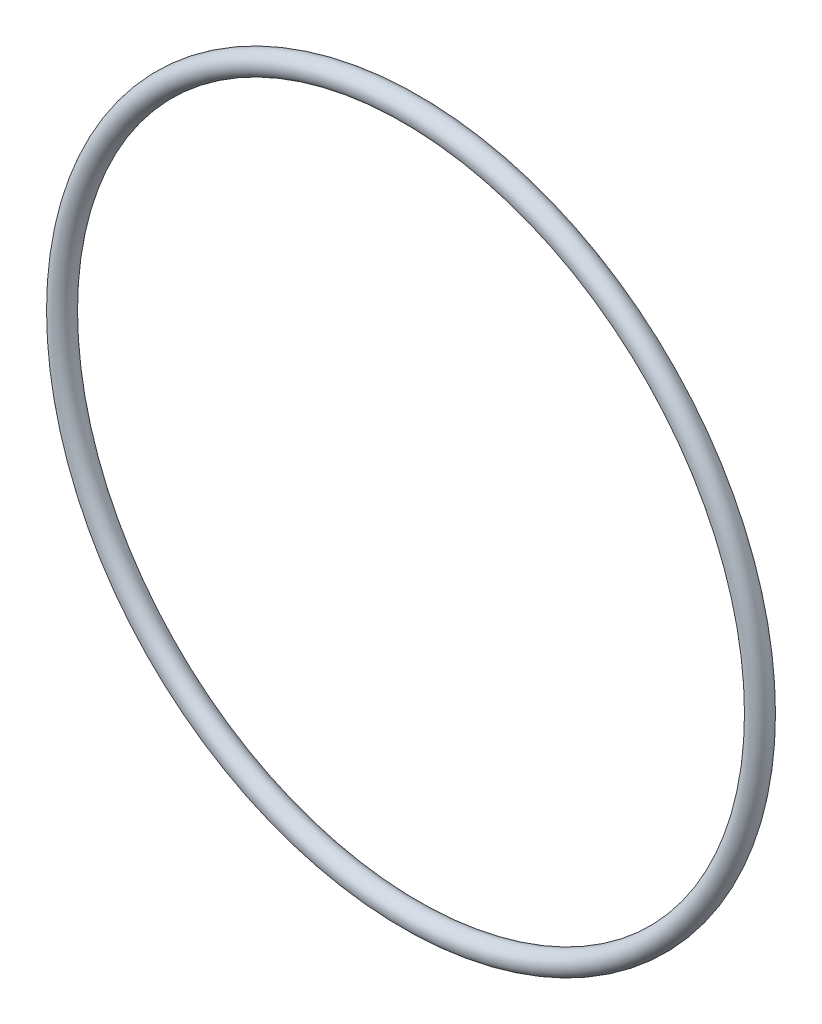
ISO-10303-21;
HEADER;
FILE_DESCRIPTION(('STEP AP214'),'2;1');
FILE_NAME('part.step','',(''),(''),'','','');
FILE_SCHEMA(('AUTOMOTIVE_DESIGN { 1 0 10303 214 1 1 1 1 }'));
ENDSEC;
DATA;
#1=APPLICATION_CONTEXT('core data for automotive mechanical design processes');
#2=APPLICATION_PROTOCOL_DEFINITION('international standard','automotive_design',2000,#1);
#3=PRODUCT_CONTEXT('',#1,'mechanical');
#4=PRODUCT('Part','Part','',(#3));
#5=PRODUCT_RELATED_PRODUCT_CATEGORY('part','',(#4));
#6=PRODUCT_DEFINITION_FORMATION('','',#4);
#7=PRODUCT_DEFINITION_CONTEXT('part definition',#1,'design');
#8=PRODUCT_DEFINITION('design','',#6,#7);
#9=PRODUCT_DEFINITION_SHAPE('','',#8);
#10=(LENGTH_UNIT() NAMED_UNIT(*) SI_UNIT(.MILLI.,.METRE.));
#11=(NAMED_UNIT(*) PLANE_ANGLE_UNIT() SI_UNIT($,.RADIAN.));
#12=(NAMED_UNIT(*) SI_UNIT($,.STERADIAN.) SOLID_ANGLE_UNIT());
#13=UNCERTAINTY_MEASURE_WITH_UNIT(LENGTH_MEASURE(1.E-05),#10,'distance_accuracy_value','');
#14=(GEOMETRIC_REPRESENTATION_CONTEXT(3) GLOBAL_UNCERTAINTY_ASSIGNED_CONTEXT((#13)) GLOBAL_UNIT_ASSIGNED_CONTEXT((#10,
#11,#12)) REPRESENTATION_CONTEXT('',''));
#15=CARTESIAN_POINT('',(0.,0.,0.));
#16=DIRECTION('',(0.,0.,1.));
#17=DIRECTION('',(1.,0.,0.));
#18=AXIS2_PLACEMENT_3D('',#15,#16,#17);
#19=CARTESIAN_POINT('',(0.,0.,0.));
#20=DIRECTION('',(0.,0.,1.));
#21=DIRECTION('',(1.,0.,0.));
#22=AXIS2_PLACEMENT_3D('',#19,#20,#21);
#23=TOROIDAL_SURFACE('',#22,111.125,3.49249999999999);
#24=CARTESIAN_POINT('',(114.6175,0.,0.));
#25=VERTEX_POINT('',#24);
#26=VERTEX_LOOP('',#25);
#27=FACE_BOUND('',#26,.T.);
#28=ADVANCED_FACE('F30',(#27),#23,.T.);
#29=CLOSED_SHELL('',(#28));
#30=MANIFOLD_SOLID_BREP('B2',#29);
#31=ADVANCED_BREP_SHAPE_REPRESENTATION('',(#18,#30),#14);
#32=SHAPE_DEFINITION_REPRESENTATION(#9,#31);
ENDSEC;
END-ISO-10303-21;
